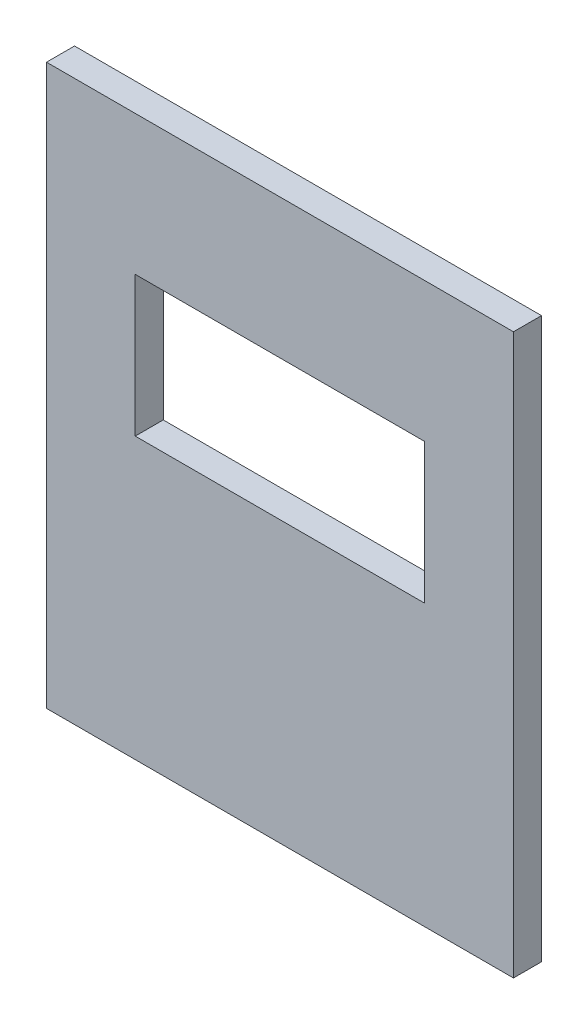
from build123d import *

# Parameters (mm, degrees)
ESQUISSE1_W        = 50
ESQUISSE1_H        = 59.925925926
ESQUISSE1_W_2      = 31
ESQUISSE1_H_2      = 15
BOSS_EXTRU_1_DEPTH = 3


with BuildPart() as part:
    # Esquisse1 → Boss.-Extru.1 (new body)
    with BuildSketch(Plane.XY):
        with Locations((-8.82380297, -2.694444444)):
            Rectangle(ESQUISSE1_W, ESQUISSE1_H)
        with Locations((-8.82380297, 4.842592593)):
            Rectangle(ESQUISSE1_W_2, ESQUISSE1_H_2, mode=Mode.SUBTRACT)
    extrude(amount=BOSS_EXTRU_1_DEPTH)


solid = part.part
